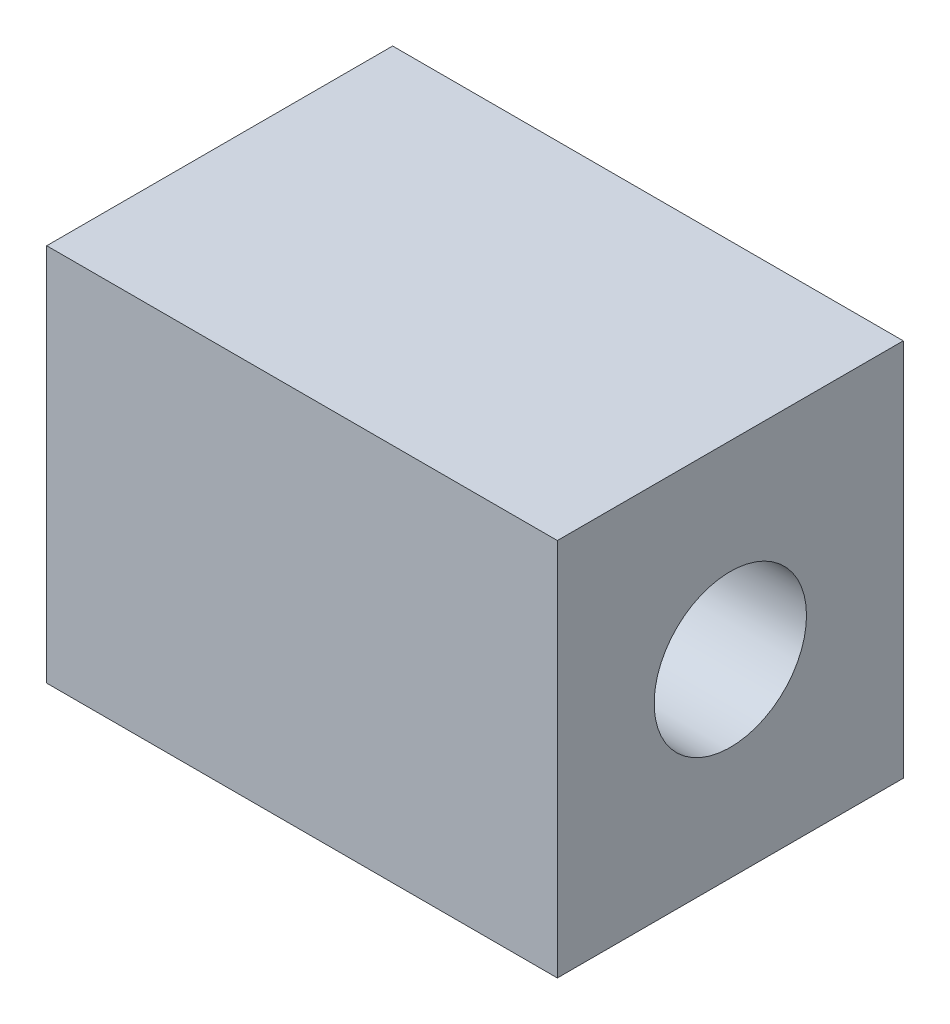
from build123d import *

# Parameters (mm, degrees)
ESQUISSE1_W                = 62
ESQUISSE1_H                = 46
EXTRUSION1_DEPTH           = 42
TROU_TARAUD_M20X1_51_D     = 18.5
TROU_TARAUD_M20X1_51_DEPTH = 65
TROU_TARAUD_M20X1_51_TIP   = 5.557960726


with BuildPart() as part:
    # Esquisse1 → Extrusion1 (new body)
    with BuildSketch(Plane.XY):
        with Locations((31, 23)):
            Rectangle(ESQUISSE1_W, ESQUISSE1_H)
    extrude(amount=EXTRUSION1_DEPTH)

    # Trou taraud_ M20x1.51
    with Locations(Plane(origin=(62, 0, 0), x_dir=(0, 0, -1), z_dir=(1, 0, 0))):
        with Locations((-21, 23)):
            Hole(TROU_TARAUD_M20X1_51_D / 2, depth=TROU_TARAUD_M20X1_51_DEPTH)
            with Locations((0, 0, -(TROU_TARAUD_M20X1_51_DEPTH + TROU_TARAUD_M20X1_51_TIP / 2))):  # 118° drill point
                Cone(0, TROU_TARAUD_M20X1_51_D / 2, TROU_TARAUD_M20X1_51_TIP, mode=Mode.SUBTRACT)


solid = part.part
